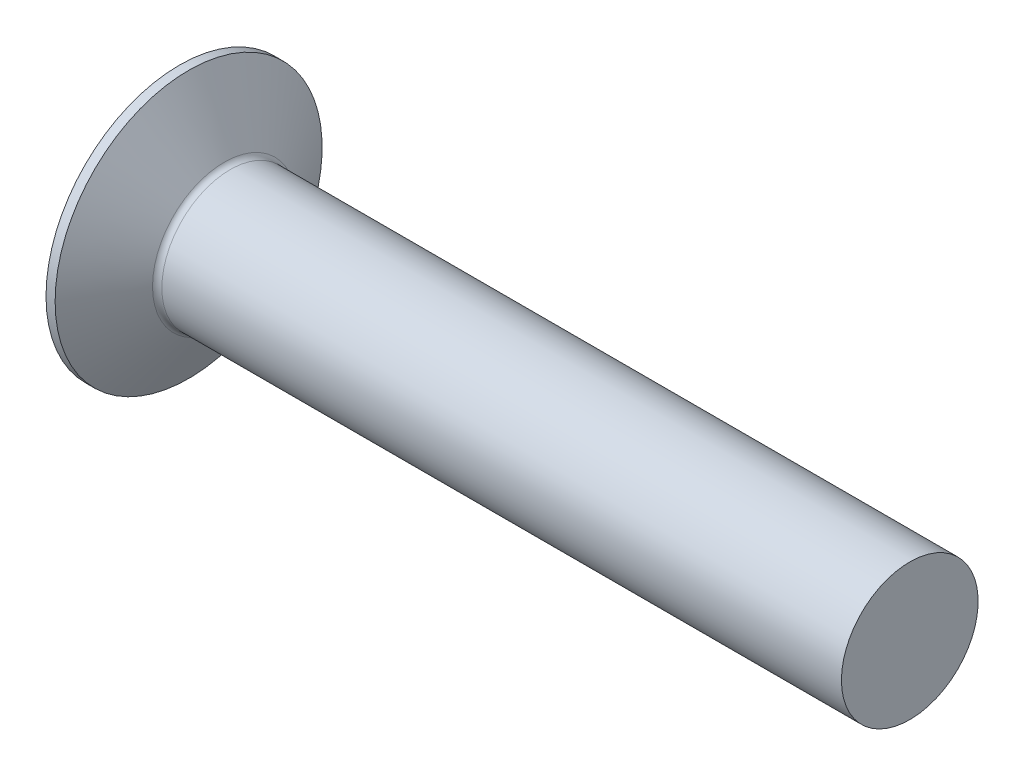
from build123d import *


with BuildPart() as part:
    # Sketch1 → Base-Revolve (revolve)
    with BuildSketch(Plane.XY, mode=Mode.PRIVATE) as base_revolve_sk:
        with BuildLine():
            Line((32.977472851, 0), (32.977472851, 3))
            Line((32.977472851, 3), (3.150677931, 3))
            ThreePointArc((3.150677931, 3), (3.000677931, 3.040192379), (2.89087031, 3.15))
            Line((2.89087031, 3.15), (1.326251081, 5.86))
            Line((1.326251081, 5.86), (0.926251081, 5.86))
            ThreePointArc((0.926251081, 5.86), (0.232991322, 2.96637578), (0, 0))
            Line((0, 0), (32.977472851, 0))
        make_face()
    revolve(base_revolve_sk.sketch.rotate(Axis((-58.143296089, 0, 0), (1, 0, 0)), 90), axis=Axis((-58.143296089, 0, 0), (1, 0, 0)))


solid = part.part
